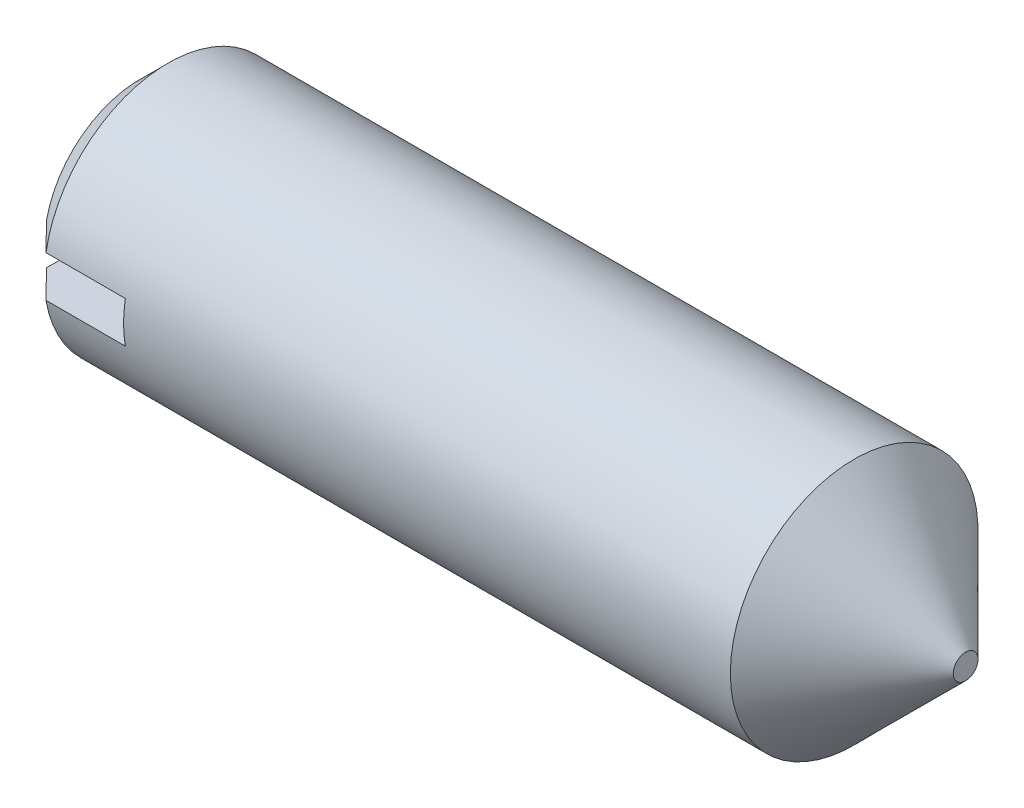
from build123d import *

# Parameters (mm, degrees)
NOTCH_DEPTH      = 5.08900966
NOTCH_DEPTH_BACK = 5.08900966
SKETCH2_W        = 0.52
SKETCH2_H        = 0.2


with BuildPart() as part:
    # Sketch1 → Base (revolve)
    with BuildSketch(Plane.XY, mode=Mode.PRIVATE) as base_sk:
        Polygon((0, 0), (4, 0), (4, 0.06), (3.46, 0.6), (0.1355, 0.6), (0, 0.4645), align=None)
    revolve(base_sk.sketch.rotate(Axis((-14.774129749, 0, 0), (1, 0, 0)), 90), axis=Axis((-14.774129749, 0, 0), (1, 0, 0)))

    # Sketch2 → Notch (cut, two sides: drawn at the far end of the back side and taken through both)
    with BuildSketch(Plane.XY.offset(-NOTCH_DEPTH_BACK)):
        with Locations((0.26, 0)):
            Rectangle(SKETCH2_W, SKETCH2_H)
    extrude(amount=NOTCH_DEPTH + NOTCH_DEPTH_BACK, mode=Mode.SUBTRACT)


solid = part.part
